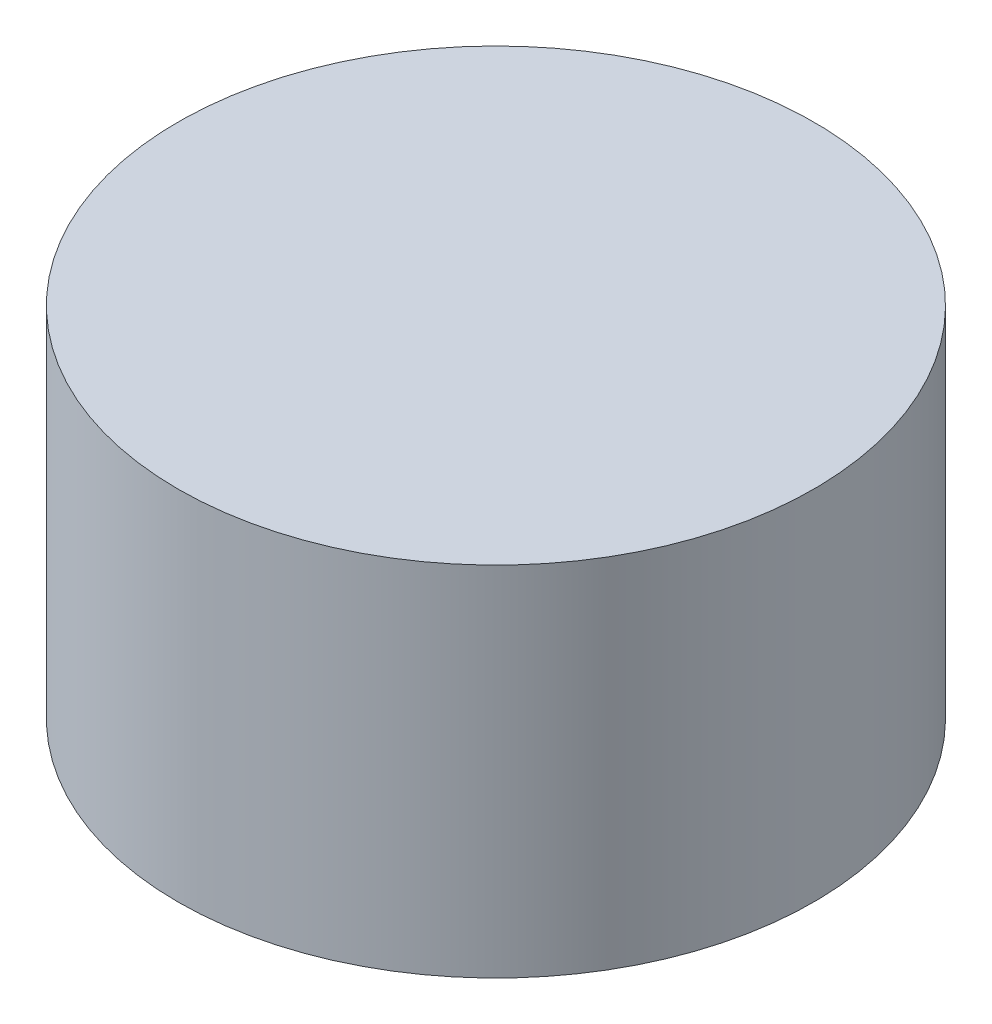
ISO-10303-21;
HEADER;
FILE_DESCRIPTION(('STEP AP214'),'2;1');
FILE_NAME('part.step','',(''),(''),'','','');
FILE_SCHEMA(('AUTOMOTIVE_DESIGN { 1 0 10303 214 1 1 1 1 }'));
ENDSEC;
DATA;
#1=APPLICATION_CONTEXT('core data for automotive mechanical design processes');
#2=APPLICATION_PROTOCOL_DEFINITION('international standard','automotive_design',2000,#1);
#3=PRODUCT_CONTEXT('',#1,'mechanical');
#4=PRODUCT('Part','Part','',(#3));
#5=PRODUCT_RELATED_PRODUCT_CATEGORY('part','',(#4));
#6=PRODUCT_DEFINITION_FORMATION('','',#4);
#7=PRODUCT_DEFINITION_CONTEXT('part definition',#1,'design');
#8=PRODUCT_DEFINITION('design','',#6,#7);
#9=PRODUCT_DEFINITION_SHAPE('','',#8);
#10=(LENGTH_UNIT() NAMED_UNIT(*) SI_UNIT(.MILLI.,.METRE.));
#11=(NAMED_UNIT(*) PLANE_ANGLE_UNIT() SI_UNIT($,.RADIAN.));
#12=(NAMED_UNIT(*) SI_UNIT($,.STERADIAN.) SOLID_ANGLE_UNIT());
#13=UNCERTAINTY_MEASURE_WITH_UNIT(LENGTH_MEASURE(1.E-05),#10,'distance_accuracy_value','');
#14=(GEOMETRIC_REPRESENTATION_CONTEXT(3) GLOBAL_UNCERTAINTY_ASSIGNED_CONTEXT((#13)) GLOBAL_UNIT_ASSIGNED_CONTEXT((#10,
#11,#12)) REPRESENTATION_CONTEXT('',''));
#15=CARTESIAN_POINT('',(0.,0.,0.));
#16=DIRECTION('',(0.,0.,1.));
#17=DIRECTION('',(1.,0.,0.));
#18=AXIS2_PLACEMENT_3D('',#15,#16,#17);
#19=CARTESIAN_POINT('',(0.,2.286,0.));
#20=DIRECTION('',(0.,-1.,0.));
#21=DIRECTION('',(0.,0.,-1.));
#22=AXIS2_PLACEMENT_3D('',#19,#20,#21);
#23=CYLINDRICAL_SURFACE('',#22,4.064);
#24=CARTESIAN_POINT('',(0.,2.286,0.));
#25=DIRECTION('',(0.,1.,0.));
#26=DIRECTION('',(0.,0.,1.));
#27=AXIS2_PLACEMENT_3D('',#24,#25,#26);
#28=CIRCLE('',#27,4.064);
#29=CARTESIAN_POINT('',(0.,2.286,4.064));
#30=VERTEX_POINT('',#29);
#31=EDGE_CURVE('E10',#30,#30,#28,.T.);
#32=ORIENTED_EDGE('',*,*,#31,.F.);
#33=EDGE_LOOP('',(#32));
#34=FACE_BOUND('',#33,.T.);
#35=CARTESIAN_POINT('',(0.,-2.286,0.));
#36=DIRECTION('',(0.,1.,0.));
#37=DIRECTION('',(0.,0.,1.));
#38=AXIS2_PLACEMENT_3D('',#35,#36,#37);
#39=CIRCLE('',#38,4.064);
#40=CARTESIAN_POINT('',(0.,-2.286,4.064));
#41=VERTEX_POINT('',#40);
#42=EDGE_CURVE('E42',#41,#41,#39,.T.);
#43=ORIENTED_EDGE('',*,*,#42,.T.);
#44=EDGE_LOOP('',(#43));
#45=FACE_BOUND('',#44,.T.);
#46=ADVANCED_FACE('F39',(#34,#45),#23,.T.);
#47=CARTESIAN_POINT('',(0.,2.286,0.));
#48=DIRECTION('',(0.,1.,0.));
#49=DIRECTION('',(0.,0.,1.));
#50=AXIS2_PLACEMENT_3D('',#47,#48,#49);
#51=PLANE('',#50);
#52=ORIENTED_EDGE('',*,*,#31,.T.);
#53=EDGE_LOOP('',(#52));
#54=FACE_BOUND('',#53,.T.);
#55=ADVANCED_FACE('F54',(#54),#51,.T.);
#56=CARTESIAN_POINT('',(0.,-2.286,0.));
#57=DIRECTION('',(0.,1.,0.));
#58=DIRECTION('',(0.,0.,1.));
#59=AXIS2_PLACEMENT_3D('',#56,#57,#58);
#60=PLANE('',#59);
#61=ORIENTED_EDGE('',*,*,#42,.F.);
#62=EDGE_LOOP('',(#61));
#63=FACE_BOUND('',#62,.T.);
#64=ADVANCED_FACE('F52',(#63),#60,.F.);
#65=CLOSED_SHELL('',(#46,#55,#64));
#66=MANIFOLD_SOLID_BREP('B2',#65);
#67=ADVANCED_BREP_SHAPE_REPRESENTATION('',(#18,#66),#14);
#68=SHAPE_DEFINITION_REPRESENTATION(#9,#67);
ENDSEC;
END-ISO-10303-21;
